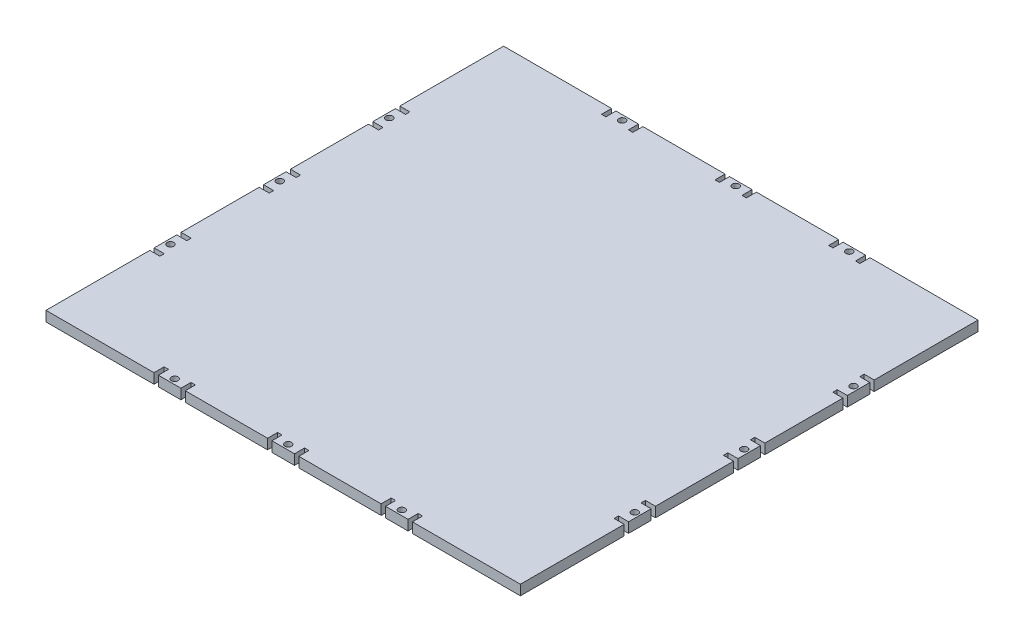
from build123d import *

# Parameters (mm, degrees)
SKETCH1_W           = 282
SKETCH1_H           = 272
BOSS_EXTRUDE1_DEPTH = 6
SKETCH2_R           = 2
SKETCH2_W           = 6
SKETCH2_H           = 2.6
SKETCH2_W_2         = 2.6
SKETCH2_H_2         = 6
CUT_EXTRUDE1_DEPTH  = 196.992346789


with BuildPart() as part:
    # Sketch1 → Boss-Extrude1 (new body)
    with BuildSketch(Plane(origin=(0, 0, 0), x_dir=(1, 0, 0), z_dir=(0, 1, 0))):
        Rectangle(SKETCH1_W, SKETCH1_H)
    extrude(amount=BOSS_EXTRUDE1_DEPTH)

    # Sketch2 → Cut-Extrude1 (cut, through all)
    with BuildSketch(Plane(origin=(0, 6, 0), x_dir=(1, 0, 0), z_dir=(0, 1, 0))):
        with Locations(Location((-138, 65, 0), (0, 0, 270))):
            Circle(SKETCH2_R)
        with Locations(Location((-138, 0, 0), (0, 0, 270))):
            Circle(SKETCH2_R)
        with Locations(Location((-138, -65, 0), (0, 0, 270))):
            Circle(SKETCH2_R)
        with Locations(Location((-67.5, 133, 0), (0, 0, 270))):
            Circle(SKETCH2_R)
        with Locations(Location((0, 133, 0), (0, 0, 270))):
            Circle(SKETCH2_R)
        with Locations(Location((67.5, 133, 0), (0, 0, 270))):
            Circle(SKETCH2_R)
        with Locations(Location((67.5, -133, 0), (0, 0, 90))):
            Circle(SKETCH2_R)
        with Locations(Location((0, -133, 0), (0, 0, 90))):
            Circle(SKETCH2_R)
        with Locations(Location((-67.5, -133, 0), (0, 0, 90))):
            Circle(SKETCH2_R)
        with Locations(Location((138, -65, 0), (0, 0, 90))):
            Circle(SKETCH2_R)
        with Locations(Location((138, 0, 0), (0, 0, 90))):
            Circle(SKETCH2_R)
        with Locations(Location((138, 65, 0), (0, 0, 90))):
            Circle(SKETCH2_R)
        with Locations((-138, 73)):
            Rectangle(SKETCH2_W, SKETCH2_H)
        with Locations((-138, 57)):
            Rectangle(SKETCH2_W, SKETCH2_H)
        with Locations((-138, 8)):
            Rectangle(SKETCH2_W, SKETCH2_H)
        with Locations((-138, -8)):
            Rectangle(SKETCH2_W, SKETCH2_H)
        with Locations((-138, -57)):
            Rectangle(SKETCH2_W, SKETCH2_H)
        with Locations((-138, -73)):
            Rectangle(SKETCH2_W, SKETCH2_H)
        with Locations((-75.5, 133)):
            Rectangle(SKETCH2_W_2, SKETCH2_H_2)
        with Locations((59.5, -133)):
            Rectangle(SKETCH2_W_2, SKETCH2_H_2)
        with Locations((75.5, -133)):
            Rectangle(SKETCH2_W_2, SKETCH2_H_2)
        with Locations((-59.5, 133)):
            Rectangle(SKETCH2_W_2, SKETCH2_H_2)
        with Locations((8, 133)):
            Rectangle(SKETCH2_W_2, SKETCH2_H_2)
        with Locations((-8, 133)):
            Rectangle(SKETCH2_W_2, SKETCH2_H_2)
        with Locations((75.5, 133)):
            Rectangle(SKETCH2_W_2, SKETCH2_H_2)
        with Locations((59.5, 133)):
            Rectangle(SKETCH2_W_2, SKETCH2_H_2)
        with Locations((-8, -133)):
            Rectangle(SKETCH2_W_2, SKETCH2_H_2)
        with Locations((8, -133)):
            Rectangle(SKETCH2_W_2, SKETCH2_H_2)
        with Locations((-59.5, -133)):
            Rectangle(SKETCH2_W_2, SKETCH2_H_2)
        with Locations((-75.5, -133)):
            Rectangle(SKETCH2_W_2, SKETCH2_H_2)
        with Locations((138, -73)):
            Rectangle(SKETCH2_W, SKETCH2_H)
        with Locations((138, -57)):
            Rectangle(SKETCH2_W, SKETCH2_H)
        with Locations((138, -8)):
            Rectangle(SKETCH2_W, SKETCH2_H)
        with Locations((138, 8)):
            Rectangle(SKETCH2_W, SKETCH2_H)
        with Locations((138, 57)):
            Rectangle(SKETCH2_W, SKETCH2_H)
        with Locations((138, 73)):
            Rectangle(SKETCH2_W, SKETCH2_H)
    extrude(amount=-CUT_EXTRUDE1_DEPTH, mode=Mode.SUBTRACT)


solid = part.part
